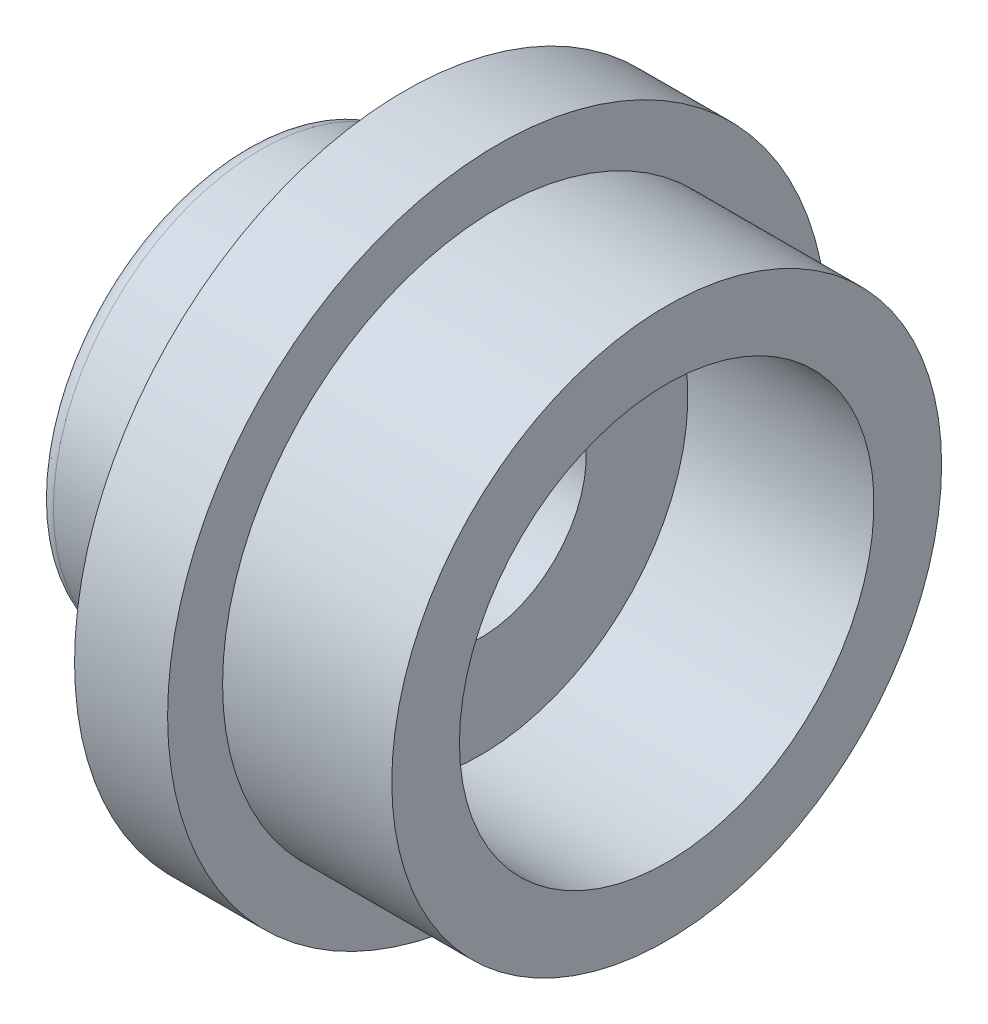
from build123d import *

# Parameters (mm, degrees)
VERRUNDUNG1_R = 0.2


with BuildPart() as part:
    # Skizze1 → Rotation1 (revolve)
    with BuildSketch(Plane.XY, mode=Mode.PRIVATE) as rotation1_sk:
        Polygon((5, 3.25), (5, 2.45), (2.8, 2.45), (2.8, 1.25), (1.2, 1.25), (1.2, 0), (0, 0), (0, 2.45), (1.9, 2.45), (1.9, 3.9), (3, 3.9), (3, 3.25), align=None)
    revolve(rotation1_sk.sketch.rotate(Axis((0, 0, 0), (1, 0, 0)), 90), axis=Axis((0, 0, 0), (1, 0, 0)))

    # Verrundung1
    verrundung1_edges = [part.edges().sort_by_distance(p)[0] for p in [
        (0, 0, -2.45),
    ]]
    fillet(verrundung1_edges, radius=VERRUNDUNG1_R)


solid = part.part
